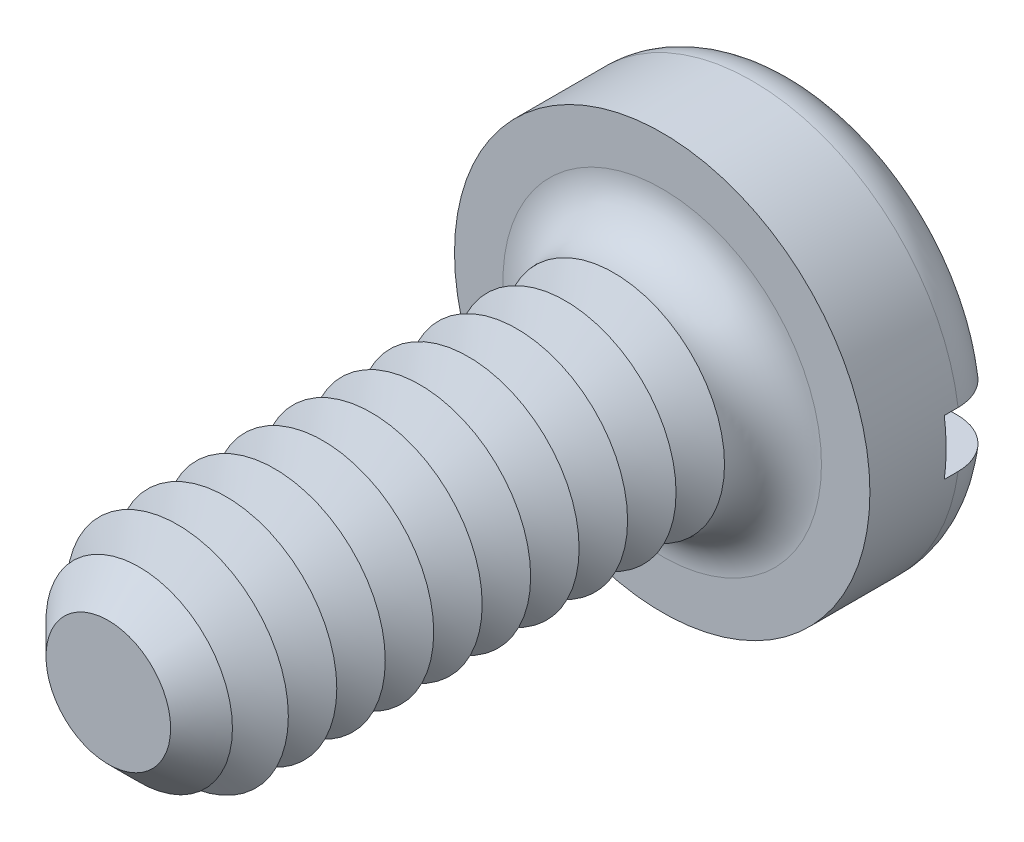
ISO-10303-21;
HEADER;
FILE_DESCRIPTION(('STEP AP214'),'2;1');
FILE_NAME('part.step','',(''),(''),'','','');
FILE_SCHEMA(('AUTOMOTIVE_DESIGN { 1 0 10303 214 1 1 1 1 }'));
ENDSEC;
DATA;
#1=APPLICATION_CONTEXT('core data for automotive mechanical design processes');
#2=APPLICATION_PROTOCOL_DEFINITION('international standard','automotive_design',2000,#1);
#3=PRODUCT_CONTEXT('',#1,'mechanical');
#4=PRODUCT('Part','Part','',(#3));
#5=PRODUCT_RELATED_PRODUCT_CATEGORY('part','',(#4));
#6=PRODUCT_DEFINITION_FORMATION('','',#4);
#7=PRODUCT_DEFINITION_CONTEXT('part definition',#1,'design');
#8=PRODUCT_DEFINITION('design','',#6,#7);
#9=PRODUCT_DEFINITION_SHAPE('','',#8);
#10=(LENGTH_UNIT() NAMED_UNIT(*) SI_UNIT(.MILLI.,.METRE.));
#11=(NAMED_UNIT(*) PLANE_ANGLE_UNIT() SI_UNIT($,.RADIAN.));
#12=(NAMED_UNIT(*) SI_UNIT($,.STERADIAN.) SOLID_ANGLE_UNIT());
#13=UNCERTAINTY_MEASURE_WITH_UNIT(LENGTH_MEASURE(1.E-05),#10,'distance_accuracy_value','');
#14=(GEOMETRIC_REPRESENTATION_CONTEXT(3) GLOBAL_UNCERTAINTY_ASSIGNED_CONTEXT((#13)) GLOBAL_UNIT_ASSIGNED_CONTEXT((#10,
#11,#12)) REPRESENTATION_CONTEXT('',''));
#15=CARTESIAN_POINT('',(0.,0.,0.));
#16=DIRECTION('',(0.,0.,1.));
#17=DIRECTION('',(1.,0.,0.));
#18=AXIS2_PLACEMENT_3D('',#15,#16,#17);
#19=CARTESIAN_POINT('',(0.,0.,-1.));
#20=DIRECTION('',(0.,0.,1.));
#21=DIRECTION('',(1.,0.,0.));
#22=AXIS2_PLACEMENT_3D('',#19,#20,#21);
#23=PLANE('',#22);
#24=CARTESIAN_POINT('',(0.,0.,-1.));
#25=DIRECTION('',(0.,0.,1.));
#26=DIRECTION('',(1.,0.,0.));
#27=AXIS2_PLACEMENT_3D('',#24,#25,#26);
#28=CIRCLE('',#27,1.15);
#29=CARTESIAN_POINT('',(-1.13247516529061,0.2,-1.));
#30=VERTEX_POINT('',#29);
#31=CARTESIAN_POINT('',(1.13247516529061,0.2,-1.));
#32=VERTEX_POINT('',#31);
#33=EDGE_CURVE('E116',#30,#32,#28,.F.);
#34=ORIENTED_EDGE('',*,*,#33,.T.);
#35=DIRECTION('',(1.,0.,0.));
#36=VECTOR('',#35,1.);
#37=CARTESIAN_POINT('',(-1.5,0.2,-1.));
#38=LINE('',#37,#36);
#39=EDGE_CURVE('E111',#30,#32,#38,.T.);
#40=ORIENTED_EDGE('',*,*,#39,.F.);
#41=EDGE_LOOP('',(#34,#40));
#42=FACE_BOUND('',#41,.T.);
#43=ADVANCED_FACE('F39',(#42),#23,.F.);
#44=CARTESIAN_POINT('',(0.,0.,-0.65));
#45=DIRECTION('',(0.,0.,1.));
#46=DIRECTION('',(1.,0.,0.));
#47=AXIS2_PLACEMENT_3D('',#44,#45,#46);
#48=TOROIDAL_SURFACE('',#47,1.15,0.35);
#49=CARTESIAN_POINT('',(-1.38697162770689,0.2,-0.89359719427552));
#50=CARTESIAN_POINT('',(-1.37305556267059,0.2,-0.907805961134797));
#51=CARTESIAN_POINT('',(-1.35791811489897,0.2,-0.9208403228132));
#52=CARTESIAN_POINT('',(-1.32565069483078,0.2,-0.944183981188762));
#53=CARTESIAN_POINT('',(-1.3085180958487,0.2,-0.954489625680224));
#54=CARTESIAN_POINT('',(-1.27278567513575,0.2,-0.972077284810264));
#55=CARTESIAN_POINT('',(-1.25418732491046,0.2,-0.979362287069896));
#56=CARTESIAN_POINT('',(-1.21604452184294,0.2,-0.990735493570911));
#57=CARTESIAN_POINT('',(-1.19650030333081,0.2,-0.994824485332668));
#58=CARTESIAN_POINT('',(-1.15682398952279,0.2,-0.99973845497));
#59=CARTESIAN_POINT('',(-1.1366881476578,0.2,-1.00053316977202));
#60=CARTESIAN_POINT('',(-1.09656272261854,0.2,-0.998770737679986));
#61=CARTESIAN_POINT('',(-1.07657315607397,0.2,-0.996213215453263));
#62=CARTESIAN_POINT('',(-1.03707277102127,0.2,-0.987780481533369));
#63=CARTESIAN_POINT('',(-1.01756977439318,0.2,-0.981868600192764));
#64=CARTESIAN_POINT('',(-0.979825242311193,0.2,-0.966867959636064));
#65=CARTESIAN_POINT('',(-0.961583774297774,0.2,-0.957779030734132));
#66=CARTESIAN_POINT('',(-0.926815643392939,0.2,-0.936628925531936));
#67=CARTESIAN_POINT('',(-0.910295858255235,0.2,-0.924556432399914));
#68=CARTESIAN_POINT('',(-0.879544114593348,0.2,-0.897781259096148));
#69=CARTESIAN_POINT('',(-0.8653120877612,0.2,-0.883078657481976));
#70=CARTESIAN_POINT('',(-0.83972745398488,0.2,-0.851619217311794));
#71=CARTESIAN_POINT('',(-0.8283448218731,0.2,-0.834886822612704));
#72=CARTESIAN_POINT('',(-0.80863848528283,0.2,-0.799707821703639));
#73=CARTESIAN_POINT('',(-0.80031425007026,0.2,-0.781261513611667));
#74=CARTESIAN_POINT('',(-0.787199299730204,0.2,-0.743695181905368));
#75=CARTESIAN_POINT('',(-0.782321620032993,0.2,-0.724605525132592));
#76=CARTESIAN_POINT('',(-0.775930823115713,0.2,-0.685871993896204));
#77=CARTESIAN_POINT('',(-0.774417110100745,0.2,-0.666228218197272));
#78=CARTESIAN_POINT('',(-0.774805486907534,0.2,-0.627456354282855));
#79=CARTESIAN_POINT('',(-0.776625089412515,0.2,-0.608327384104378));
#80=CARTESIAN_POINT('',(-0.783452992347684,0.2,-0.570648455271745));
#81=CARTESIAN_POINT('',(-0.788461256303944,0.2,-0.552098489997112));
#82=CARTESIAN_POINT('',(-0.801489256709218,0.2,-0.516098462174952));
#83=CARTESIAN_POINT('',(-0.809507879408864,0.2,-0.49864799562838));
#84=CARTESIAN_POINT('',(-0.828295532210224,0.2,-0.465297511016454));
#85=CARTESIAN_POINT('',(-0.839064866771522,0.2,-0.449397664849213));
#86=CARTESIAN_POINT('',(-0.863311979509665,0.2,-0.419196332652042));
#87=CARTESIAN_POINT('',(-0.876847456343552,0.2,-0.404941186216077));
#88=CARTESIAN_POINT('',(-0.906064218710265,0.2,-0.378832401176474));
#89=CARTESIAN_POINT('',(-0.921745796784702,0.2,-0.366979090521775));
#90=CARTESIAN_POINT('',(-0.955261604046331,0.2,-0.345690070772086));
#91=CARTESIAN_POINT('',(-0.973141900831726,0.2,-0.336326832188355));
#92=CARTESIAN_POINT('',(-1.01020647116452,0.2,-0.320690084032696));
#93=CARTESIAN_POINT('',(-1.02939085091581,0.2,-0.314416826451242));
#94=CARTESIAN_POINT('',(-1.06878849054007,0.2,-0.305073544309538));
#95=CARTESIAN_POINT('',(-1.0890118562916,0.2,-0.302046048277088));
#96=CARTESIAN_POINT('',(-1.12968032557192,0.2,-0.299436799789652));
#97=CARTESIAN_POINT('',(-1.15012542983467,0.2,-0.299855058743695));
#98=CARTESIAN_POINT('',(-1.1906059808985,0.2,-0.304138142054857));
#99=CARTESIAN_POINT('',(-1.21064224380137,0.2,-0.307995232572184));
#100=CARTESIAN_POINT('',(-1.24976957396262,0.2,-0.319055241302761));
#101=CARTESIAN_POINT('',(-1.26886068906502,0.2,-0.326257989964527));
#102=CARTESIAN_POINT('',(-1.30533597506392,0.2,-0.343725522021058));
#103=CARTESIAN_POINT('',(-1.32273620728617,0.2,-0.353956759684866));
#104=CARTESIAN_POINT('',(-1.35554323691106,0.2,-0.377229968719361));
#105=CARTESIAN_POINT('',(-1.37095016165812,0.2,-0.390271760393));
#106=CARTESIAN_POINT('',(-1.39913145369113,0.2,-0.418621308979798));
#107=CARTESIAN_POINT('',(-1.41193602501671,0.2,-0.43389904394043));
#108=CARTESIAN_POINT('',(-1.43476712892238,0.2,-0.46640589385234));
#109=CARTESIAN_POINT('',(-1.44479381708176,0.2,-0.483634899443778));
#110=CARTESIAN_POINT('',(-1.4616814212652,0.2,-0.519367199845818));
#111=CARTESIAN_POINT('',(-1.46857323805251,0.2,-0.537855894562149));
#112=CARTESIAN_POINT('',(-1.4791331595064,0.2,-0.575731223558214));
#113=CARTESIAN_POINT('',(-1.48280152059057,0.2,-0.595117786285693));
#114=CARTESIAN_POINT('',(-1.4867930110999,0.2,-0.634109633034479));
#115=CARTESIAN_POINT('',(-1.48713684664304,0.2,-0.653712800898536));
#116=CARTESIAN_POINT('',(-1.48452244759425,0.2,-0.692702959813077));
#117=CARTESIAN_POINT('',(-1.48156342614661,0.2,-0.712089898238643));
#118=CARTESIAN_POINT('',(-1.47243636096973,0.2,-0.75006822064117));
#119=CARTESIAN_POINT('',(-1.46627182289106,0.2,-0.768660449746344));
#120=CARTESIAN_POINT('',(-1.45092056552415,0.2,-0.804533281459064));
#121=CARTESIAN_POINT('',(-1.44173755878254,0.2,-0.821815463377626));
#122=CARTESIAN_POINT('',(-1.42477940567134,0.2,-0.848152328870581));
#123=CARTESIAN_POINT('',(-1.41786672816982,0.2,-0.857773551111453));
#124=CARTESIAN_POINT('',(-1.40310412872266,0.2,-0.876267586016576));
#125=CARTESIAN_POINT('',(-1.39525421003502,0.2,-0.885140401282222));
#126=CARTESIAN_POINT('',(-1.38697162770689,0.2,-0.89359719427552));
#127=B_SPLINE_CURVE_WITH_KNOTS('',3,(#49,#50,#51,#52,#53,#54,#55,#56,#57,#58,#59,#60,#61,#62,
#63,#64,#65,#66,#67,#68,#69,#70,#71,#72,#73,#74,#75,#76,#77,#78,#79,#80,#81,#82,#83,#84,#85,#86,
#87,#88,#89,#90,#91,#92,#93,#94,#95,#96,#97,#98,#99,#100,#101,#102,#103,#104,#105,#106,#107,
#108,#109,#110,#111,#112,#113,#114,#115,#116,#117,#118,#119,#120,#121,#122,#123,#124,#125,#126),
.UNSPECIFIED.,.T.,.F.,(4,2,2,2,2,2,2,2,2,2,2,2,2,2,2,2,2,2,2,2,2,2,2,2,2,2,2,2,2,2,2,2,2,2,2,2,
2,2,4),(0.,0.0596211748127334,0.119321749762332,0.178963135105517,0.238589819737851,
0.298763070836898,0.358943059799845,0.419793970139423,0.48064813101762,0.541736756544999,
0.602823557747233,0.663236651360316,0.72363925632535,0.782457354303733,0.841265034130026,
0.898637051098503,0.956008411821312,1.01335856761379,1.07071507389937,1.12941939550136,
1.18813172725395,1.24840147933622,1.30867614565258,1.36973127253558,1.43078660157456,
1.49170496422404,1.55262023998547,1.61288453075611,1.67314496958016,1.73266007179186,
1.792171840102,1.85108355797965,1.90999058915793,1.96853049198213,2.02708434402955,
2.08557429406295,2.14399257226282,2.17947810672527,2.21496351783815),.UNSPECIFIED.);
#128=CARTESIAN_POINT('',(-1.48660687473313,0.2,-0.649999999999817));
#129=VERTEX_POINT('',#128);
#130=EDGE_CURVE('E265',#129,#30,#127,.T.);
#131=ORIENTED_EDGE('',*,*,#130,.F.);
#132=CARTESIAN_POINT('',(0.,0.,-0.65));
#133=DIRECTION('',(0.,0.,1.));
#134=DIRECTION('',(1.,0.,0.));
#135=AXIS2_PLACEMENT_3D('',#132,#133,#134);
#136=CIRCLE('',#135,1.5);
#137=CARTESIAN_POINT('',(1.48660687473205,0.2,-0.649999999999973));
#138=VERTEX_POINT('',#137);
#139=EDGE_CURVE('E125',#138,#129,#136,.T.);
#140=ORIENTED_EDGE('',*,*,#139,.F.);
#141=CARTESIAN_POINT('',(0.780520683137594,0.2,-0.713112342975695));
#142=CARTESIAN_POINT('',(0.784146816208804,0.2,-0.73226748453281));
#143=CARTESIAN_POINT('',(0.789425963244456,0.2,-0.751125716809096));
#144=CARTESIAN_POINT('',(0.803106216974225,0.2,-0.78769198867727));
#145=CARTESIAN_POINT('',(0.811511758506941,0.2,-0.805398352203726));
#146=CARTESIAN_POINT('',(0.831144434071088,0.2,-0.839131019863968));
#147=CARTESIAN_POINT('',(0.842366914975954,0.2,-0.855160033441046));
#148=CARTESIAN_POINT('',(0.867288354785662,0.2,-0.88515062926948));
#149=CARTESIAN_POINT('',(0.880986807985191,0.2,-0.899112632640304));
#150=CARTESIAN_POINT('',(0.910770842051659,0.2,-0.924888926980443));
#151=CARTESIAN_POINT('',(0.926899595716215,0.2,-0.936653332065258));
#152=CARTESIAN_POINT('',(0.960871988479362,0.2,-0.957372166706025));
#153=CARTESIAN_POINT('',(0.978715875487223,0.2,-0.966326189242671));
#154=CARTESIAN_POINT('',(1.01600338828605,0.2,-0.981340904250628));
#155=CARTESIAN_POINT('',(1.03547204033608,0.2,-0.987339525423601));
#156=CARTESIAN_POINT('',(1.07513874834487,0.2,-0.995998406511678));
#157=CARTESIAN_POINT('',(1.09533683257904,0.2,-0.998658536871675));
#158=CARTESIAN_POINT('',(1.1359751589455,0.2,-1.0005575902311));
#159=CARTESIAN_POINT('',(1.1564160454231,0.2,-0.99978283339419));
#160=CARTESIAN_POINT('',(1.19687229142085,0.2,-0.994784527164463));
#161=CARTESIAN_POINT('',(1.21688766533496,0.2,-0.990561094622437));
#162=CARTESIAN_POINT('',(1.25575385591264,0.2,-0.978813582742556));
#163=CARTESIAN_POINT('',(1.27461259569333,0.2,-0.971315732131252));
#164=CARTESIAN_POINT('',(1.31078063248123,0.2,-0.953221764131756));
#165=CARTESIAN_POINT('',(1.32809002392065,0.2,-0.942625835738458));
#166=CARTESIAN_POINT('',(1.36044102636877,0.2,-0.918776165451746));
#167=CARTESIAN_POINT('',(1.37550786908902,0.2,-0.905556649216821));
#168=CARTESIAN_POINT('',(1.40317627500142,0.2,-0.876749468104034));
#169=CARTESIAN_POINT('',(1.41577799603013,0.2,-0.861161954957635));
#170=CARTESIAN_POINT('',(1.43800830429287,0.2,-0.828254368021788));
#171=CARTESIAN_POINT('',(1.44766923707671,0.2,-0.810956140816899));
#172=CARTESIAN_POINT('',(1.46392269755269,0.2,-0.774973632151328));
#173=CARTESIAN_POINT('',(1.4705153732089,0.2,-0.756289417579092));
#174=CARTESIAN_POINT('',(1.48039453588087,0.2,-0.718226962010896));
#175=CARTESIAN_POINT('',(1.48370713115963,0.2,-0.69885549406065));
#176=CARTESIAN_POINT('',(1.48701993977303,0.2,-0.659831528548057));
#177=CARTESIAN_POINT('',(1.4870202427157,0.2,-0.640179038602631));
#178=CARTESIAN_POINT('',(1.48371470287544,0.2,-0.6012267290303));
#179=CARTESIAN_POINT('',(1.48042091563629,0.2,-0.581925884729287));
#180=CARTESIAN_POINT('',(1.47064268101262,0.2,-0.544150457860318));
#181=CARTESIAN_POINT('',(1.46415824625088,0.2,-0.525675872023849));
#182=CARTESIAN_POINT('',(1.4481813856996,0.2,-0.490055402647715));
#183=CARTESIAN_POINT('',(1.43868601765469,0.2,-0.472910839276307));
#184=CARTESIAN_POINT('',(1.41696658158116,0.2,-0.440447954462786));
#185=CARTESIAN_POINT('',(1.40474246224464,0.2,-0.425129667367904));
#186=CARTESIAN_POINT('',(1.37784446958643,0.2,-0.39666049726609));
#187=CARTESIAN_POINT('',(1.36315749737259,0.2,-0.383521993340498));
#188=CARTESIAN_POINT('',(1.33180407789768,0.2,-0.359869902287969));
#189=CARTESIAN_POINT('',(1.31513754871,0.2,-0.349356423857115));
#190=CARTESIAN_POINT('',(1.28013085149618,0.2,-0.331143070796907));
#191=CARTESIAN_POINT('',(1.26177629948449,0.2,-0.323470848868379));
#192=CARTESIAN_POINT('',(1.224049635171,0.2,-0.311275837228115));
#193=CARTESIAN_POINT('',(1.20467746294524,0.2,-0.306753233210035));
#194=CARTESIAN_POINT('',(1.1652160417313,0.2,-0.300927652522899));
#195=CARTESIAN_POINT('',(1.14512096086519,0.2,-0.299664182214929));
#196=CARTESIAN_POINT('',(1.10499953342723,0.2,-0.300488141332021));
#197=CARTESIAN_POINT('',(1.08497319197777,0.2,-0.302575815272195));
#198=CARTESIAN_POINT('',(1.04531606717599,0.2,-0.310075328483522));
#199=CARTESIAN_POINT('',(1.0256923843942,0.2,-0.315524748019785));
#200=CARTESIAN_POINT('',(0.987629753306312,0.2,-0.329624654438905));
#201=CARTESIAN_POINT('',(0.96919087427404,0.2,-0.338275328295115));
#202=CARTESIAN_POINT('',(0.933939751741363,0.2,-0.358590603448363));
#203=CARTESIAN_POINT('',(0.917135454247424,0.2,-0.370269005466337));
#204=CARTESIAN_POINT('',(0.88574931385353,0.2,-0.396306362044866));
#205=CARTESIAN_POINT('',(0.87116734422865,0.2,-0.410665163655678));
#206=CARTESIAN_POINT('',(0.844813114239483,0.2,-0.441518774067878));
#207=CARTESIAN_POINT('',(0.833014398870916,0.2,-0.457990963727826));
#208=CARTESIAN_POINT('',(0.812431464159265,0.2,-0.492729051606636));
#209=CARTESIAN_POINT('',(0.803647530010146,0.2,-0.510995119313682));
#210=CARTESIAN_POINT('',(0.789590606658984,0.2,-0.548308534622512));
#211=CARTESIAN_POINT('',(0.784235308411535,0.2,-0.5673249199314));
#212=CARTESIAN_POINT('',(0.7768953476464,0.2,-0.605979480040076));
#213=CARTESIAN_POINT('',(0.774905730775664,0.2,-0.625616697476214));
#214=CARTESIAN_POINT('',(0.774470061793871,0.2,-0.656633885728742));
#215=CARTESIAN_POINT('',(0.7748847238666,0.2,-0.668009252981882));
#216=CARTESIAN_POINT('',(0.776852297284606,0.2,-0.690660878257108));
#217=CARTESIAN_POINT('',(0.77840517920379,0.2,-0.701937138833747));
#218=CARTESIAN_POINT('',(0.780520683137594,0.2,-0.713112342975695));
#219=B_SPLINE_CURVE_WITH_KNOTS('',3,(#141,#142,#143,#144,#145,#146,#147,#148,#149,#150,#151,
#152,#153,#154,#155,#156,#157,#158,#159,#160,#161,#162,#163,#164,#165,#166,#167,#168,#169,#170,
#171,#172,#173,#174,#175,#176,#177,#178,#179,#180,#181,#182,#183,#184,#185,#186,#187,#188,#189,
#190,#191,#192,#193,#194,#195,#196,#197,#198,#199,#200,#201,#202,#203,#204,#205,#206,#207,#208,
#209,#210,#211,#212,#213,#214,#215,#216,#217,#218),.UNSPECIFIED.,.T.,.F.,(4,2,2,2,2,2,2,2,2,2,2,
2,2,2,2,2,2,2,2,2,2,2,2,2,2,2,2,2,2,2,2,2,2,2,2,2,2,2,4),(0.,0.0584431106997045,
0.11696944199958,0.175399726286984,0.233818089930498,0.293433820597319,0.353058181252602,
0.413886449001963,0.474717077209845,0.53579018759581,0.596861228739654,0.65745180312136,
0.718038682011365,0.777881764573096,0.837721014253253,0.896876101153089,0.95602833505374,
1.01470585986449,1.07338179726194,1.13184377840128,1.19030552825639,1.24882458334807,
1.30734473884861,1.36618662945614,1.42503095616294,1.48443380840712,1.54384016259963,
1.60396331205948,1.66409084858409,1.72490303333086,1.78571877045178,1.84681674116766,
1.90791122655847,1.96839922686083,2.02889294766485,2.08787382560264,2.14676780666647,
2.18086468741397,2.21496068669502),.UNSPECIFIED.);
#220=EDGE_CURVE('E267',#32,#138,#219,.T.);
#221=ORIENTED_EDGE('',*,*,#220,.F.);
#222=ORIENTED_EDGE('',*,*,#33,.F.);
#223=EDGE_LOOP('',(#131,#140,#221,#222));
#224=FACE_BOUND('',#223,.T.);
#225=ADVANCED_FACE('F249',(#224),#48,.T.);
#226=CARTESIAN_POINT('',(0.,0.,-1.));
#227=DIRECTION('',(0.,0.,1.));
#228=DIRECTION('',(1.,0.,0.));
#229=AXIS2_PLACEMENT_3D('',#226,#227,#228);
#230=CYLINDRICAL_SURFACE('',#229,1.5);
#231=DIRECTION('',(0.,0.,1.));
#232=VECTOR('',#231,1.);
#233=CARTESIAN_POINT('',(1.48660687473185,0.2,-1.));
#234=LINE('',#233,#232);
#235=CARTESIAN_POINT('',(1.48660687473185,0.2,-0.55));
#236=VERTEX_POINT('',#235);
#237=EDGE_CURVE('E283',#138,#236,#234,.T.);
#238=ORIENTED_EDGE('',*,*,#237,.F.);
#239=ORIENTED_EDGE('',*,*,#139,.T.);
#240=DIRECTION('',(0.,0.,1.));
#241=VECTOR('',#240,1.);
#242=CARTESIAN_POINT('',(-1.48660687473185,0.2,-1.));
#243=LINE('',#242,#241);
#244=CARTESIAN_POINT('',(-1.48660687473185,0.2,-0.55));
#245=VERTEX_POINT('',#244);
#246=EDGE_CURVE('E63',#245,#129,#243,.F.);
#247=ORIENTED_EDGE('',*,*,#246,.F.);
#248=CARTESIAN_POINT('',(0.,0.,-0.55));
#249=DIRECTION('',(0.,0.,-1.));
#250=DIRECTION('',(-1.,0.,0.));
#251=AXIS2_PLACEMENT_3D('',#248,#249,#250);
#252=CIRCLE('',#251,1.5);
#253=CARTESIAN_POINT('',(-1.48660687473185,-0.2,-0.55));
#254=VERTEX_POINT('',#253);
#255=EDGE_CURVE('E43',#245,#254,#252,.F.);
#256=ORIENTED_EDGE('',*,*,#255,.T.);
#257=DIRECTION('',(0.,0.,1.));
#258=VECTOR('',#257,1.);
#259=CARTESIAN_POINT('',(-1.48660687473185,-0.2,-1.));
#260=LINE('',#259,#258);
#261=CARTESIAN_POINT('',(-1.48660687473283,-0.2,-0.650000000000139));
#262=VERTEX_POINT('',#261);
#263=EDGE_CURVE('E280',#262,#254,#260,.T.);
#264=ORIENTED_EDGE('',*,*,#263,.F.);
#265=CARTESIAN_POINT('',(1.48660687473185,-0.2,-0.65));
#266=VERTEX_POINT('',#265);
#267=EDGE_CURVE('E127',#262,#266,#136,.T.);
#268=ORIENTED_EDGE('',*,*,#267,.T.);
#269=DIRECTION('',(0.,0.,1.));
#270=VECTOR('',#269,1.);
#271=CARTESIAN_POINT('',(1.48660687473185,-0.2,-1.));
#272=LINE('',#271,#270);
#273=CARTESIAN_POINT('',(1.48660687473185,-0.2,-0.55));
#274=VERTEX_POINT('',#273);
#275=EDGE_CURVE('E55',#274,#266,#272,.F.);
#276=ORIENTED_EDGE('',*,*,#275,.F.);
#277=EDGE_CURVE('E11',#274,#236,#252,.F.);
#278=ORIENTED_EDGE('',*,*,#277,.T.);
#279=EDGE_LOOP('',(#238,#239,#247,#256,#264,#268,#276,#278));
#280=FACE_BOUND('',#279,.T.);
#281=CARTESIAN_POINT('',(0.,0.,0.));
#282=DIRECTION('',(0.,0.,1.));
#283=DIRECTION('',(1.,0.,0.));
#284=AXIS2_PLACEMENT_3D('',#281,#282,#283);
#285=CIRCLE('',#284,1.5);
#286=CARTESIAN_POINT('',(1.5,0.,0.));
#287=VERTEX_POINT('',#286);
#288=EDGE_CURVE('E286',#287,#287,#285,.T.);
#289=ORIENTED_EDGE('',*,*,#288,.F.);
#290=EDGE_LOOP('',(#289));
#291=FACE_BOUND('',#290,.T.);
#292=ADVANCED_FACE('F245',(#280,#291),#230,.T.);
#293=CARTESIAN_POINT('',(1.13247516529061,-0.2,-1.));
#294=VERTEX_POINT('',#293);
#295=CARTESIAN_POINT('',(-1.13247516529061,-0.2,-1.));
#296=VERTEX_POINT('',#295);
#297=EDGE_CURVE('E109',#294,#296,#28,.F.);
#298=ORIENTED_EDGE('',*,*,#297,.T.);
#299=DIRECTION('',(-1.,0.,0.));
#300=VECTOR('',#299,1.);
#301=CARTESIAN_POINT('',(-1.5,-0.2,-1.));
#302=LINE('',#301,#300);
#303=EDGE_CURVE('E96',#294,#296,#302,.T.);
#304=ORIENTED_EDGE('',*,*,#303,.F.);
#305=EDGE_LOOP('',(#298,#304));
#306=FACE_BOUND('',#305,.T.);
#307=ADVANCED_FACE('F108',(#306),#23,.F.);
#308=CARTESIAN_POINT('',(0.,0.,0.));
#309=DIRECTION('',(0.,0.,1.));
#310=DIRECTION('',(1.,0.,0.));
#311=AXIS2_PLACEMENT_3D('',#308,#309,#310);
#312=PLANE('',#311);
#313=CARTESIAN_POINT('',(0.,0.,0.));
#314=DIRECTION('',(0.,0.,1.));
#315=DIRECTION('',(1.,0.,0.));
#316=AXIS2_PLACEMENT_3D('',#313,#314,#315);
#317=CIRCLE('',#316,1.15);
#318=CARTESIAN_POINT('',(1.15,0.,0.));
#319=VERTEX_POINT('',#318);
#320=EDGE_CURVE('E115',#319,#319,#317,.F.);
#321=ORIENTED_EDGE('',*,*,#320,.T.);
#322=EDGE_LOOP('',(#321));
#323=FACE_BOUND('',#322,.T.);
#324=ORIENTED_EDGE('',*,*,#288,.T.);
#325=EDGE_LOOP('',(#324));
#326=FACE_BOUND('',#325,.T.);
#327=ADVANCED_FACE('F244',(#323,#326),#312,.T.);
#328=CARTESIAN_POINT('',(-1.38697162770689,-0.2,-0.89359719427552));
#329=CARTESIAN_POINT('',(-1.40068341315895,-0.2,-0.87959447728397));
#330=CARTESIAN_POINT('',(-1.41322919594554,-0.2,-0.864431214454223));
#331=CARTESIAN_POINT('',(-1.43561095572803,-0.2,-0.83220389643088));
#332=CARTESIAN_POINT('',(-1.44544396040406,-0.2,-0.815137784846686));
#333=CARTESIAN_POINT('',(-1.46209732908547,-0.2,-0.779595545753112));
#334=CARTESIAN_POINT('',(-1.46891825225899,-0.2,-0.761119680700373));
#335=CARTESIAN_POINT('',(-1.479344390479,-0.2,-0.723286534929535));
#336=CARTESIAN_POINT('',(-1.48295036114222,-0.2,-0.703929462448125));
#337=CARTESIAN_POINT('',(-1.48683413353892,-0.2,-0.6649653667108));
#338=CARTESIAN_POINT('',(-1.48712565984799,-0.2,-0.645359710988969));
#339=CARTESIAN_POINT('',(-1.48440736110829,-0.2,-0.606378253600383));
#340=CARTESIAN_POINT('',(-1.48139747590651,-0.2,-0.587002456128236));
#341=CARTESIAN_POINT('',(-1.47217267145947,-0.2,-0.549061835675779));
#342=CARTESIAN_POINT('',(-1.46596274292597,-0.2,-0.530495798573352));
#343=CARTESIAN_POINT('',(-1.45052327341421,-0.2,-0.494665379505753));
#344=CARTESIAN_POINT('',(-1.44129371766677,-0.2,-0.477401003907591));
#345=CARTESIAN_POINT('',(-1.42005139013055,-0.2,-0.444603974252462));
#346=CARTESIAN_POINT('',(-1.40803014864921,-0.2,-0.429076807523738));
#347=CARTESIAN_POINT('',(-1.38156905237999,-0.2,-0.400242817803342));
#348=CARTESIAN_POINT('',(-1.36712913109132,-0.2,-0.386936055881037));
#349=CARTESIAN_POINT('',(-1.33612890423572,-0.2,-0.362811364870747));
#350=CARTESIAN_POINT('',(-1.31955365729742,-0.2,-0.352012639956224));
#351=CARTESIAN_POINT('',(-1.28484098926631,-0.2,-0.333316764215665));
#352=CARTESIAN_POINT('',(-1.26670348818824,-0.2,-0.325419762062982));
#353=CARTESIAN_POINT('',(-1.22917040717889,-0.2,-0.31265726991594));
#354=CARTESIAN_POINT('',(-1.20976324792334,-0.2,-0.3078258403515));
#355=CARTESIAN_POINT('',(-1.17041685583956,-0.2,-0.30144641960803));
#356=CARTESIAN_POINT('',(-1.15047758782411,-0.2,-0.299898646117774));
#357=CARTESIAN_POINT('',(-1.11037109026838,-0.2,-0.300112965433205));
#358=CARTESIAN_POINT('',(-1.09020407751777,-0.2,-0.301916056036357));
#359=CARTESIAN_POINT('',(-1.05044996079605,-0.2,-0.308849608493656));
#360=CARTESIAN_POINT('',(-1.03086289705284,-0.2,-0.313980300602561));
#361=CARTESIAN_POINT('',(-0.992636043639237,-0.2,-0.327485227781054));
#362=CARTESIAN_POINT('',(-0.974006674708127,-0.2,-0.335888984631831));
#363=CARTESIAN_POINT('',(-0.938423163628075,-0.2,-0.355707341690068));
#364=CARTESIAN_POINT('',(-0.921469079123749,-0.2,-0.367122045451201));
#365=CARTESIAN_POINT('',(-0.889752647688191,-0.2,-0.392642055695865));
#366=CARTESIAN_POINT('',(-0.874987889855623,-0.2,-0.406744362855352));
#367=CARTESIAN_POINT('',(-0.848085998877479,-0.2,-0.437266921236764));
#368=CARTESIAN_POINT('',(-0.835948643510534,-0.2,-0.453686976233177));
#369=CARTESIAN_POINT('',(-0.814894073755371,-0.2,-0.488078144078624));
#370=CARTESIAN_POINT('',(-0.805923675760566,-0.2,-0.506016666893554));
#371=CARTESIAN_POINT('',(-0.791223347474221,-0.2,-0.543175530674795));
#372=CARTESIAN_POINT('',(-0.78549275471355,-0.2,-0.562395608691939));
#373=CARTESIAN_POINT('',(-0.777599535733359,-0.2,-0.600984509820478));
#374=CARTESIAN_POINT('',(-0.775340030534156,-0.2,-0.62033354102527));
#375=CARTESIAN_POINT('',(-0.774164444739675,-0.2,-0.659131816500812));
#376=CARTESIAN_POINT('',(-0.775247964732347,-0.2,-0.678581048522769));
#377=CARTESIAN_POINT('',(-0.78067015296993,-0.2,-0.716679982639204));
#378=CARTESIAN_POINT('',(-0.784953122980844,-0.2,-0.735337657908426));
#379=CARTESIAN_POINT('',(-0.796558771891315,-0.2,-0.771681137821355));
#380=CARTESIAN_POINT('',(-0.803881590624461,-0.2,-0.789366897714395));
#381=CARTESIAN_POINT('',(-0.821417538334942,-0.2,-0.823475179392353));
#382=CARTESIAN_POINT('',(-0.831660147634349,-0.2,-0.839882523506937));
#383=CARTESIAN_POINT('',(-0.854684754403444,-0.2,-0.870805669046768));
#384=CARTESIAN_POINT('',(-0.867467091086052,-0.2,-0.885321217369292));
#385=CARTESIAN_POINT('',(-0.895584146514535,-0.2,-0.912470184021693));
#386=CARTESIAN_POINT('',(-0.910979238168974,-0.2,-0.925041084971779));
#387=CARTESIAN_POINT('',(-0.943622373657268,-0.2,-0.947488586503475));
#388=CARTESIAN_POINT('',(-0.960870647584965,-0.2,-0.957364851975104));
#389=CARTESIAN_POINT('',(-0.997151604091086,-0.2,-0.974359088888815));
#390=CARTESIAN_POINT('',(-1.01621564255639,-0.2,-0.98141019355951));
#391=CARTESIAN_POINT('',(-1.05525219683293,-0.2,-0.992235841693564));
#392=CARTESIAN_POINT('',(-1.07522472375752,-0.2,-0.996010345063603));
#393=CARTESIAN_POINT('',(-1.11565152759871,-0.2,-1.00018247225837));
#394=CARTESIAN_POINT('',(-1.1361080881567,-0.2,-1.00055804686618));
#395=CARTESIAN_POINT('',(-1.17679659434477,-0.2,-0.997846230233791));
#396=CARTESIAN_POINT('',(-1.19702848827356,-0.2,-0.994758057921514));
#397=CARTESIAN_POINT('',(-1.23655375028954,-0.2,-0.985216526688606));
#398=CARTESIAN_POINT('',(-1.25585198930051,-0.2,-0.978783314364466));
#399=CARTESIAN_POINT('',(-1.29305658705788,-0.2,-0.962732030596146));
#400=CARTESIAN_POINT('',(-1.31096467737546,-0.2,-0.953118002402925));
#401=CARTESIAN_POINT('',(-1.33859353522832,-0.2,-0.935076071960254));
#402=CARTESIAN_POINT('',(-1.34889525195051,-0.2,-0.927521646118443));
#403=CARTESIAN_POINT('',(-1.36861998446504,-0.2,-0.911341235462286));
#404=CARTESIAN_POINT('',(-1.37804300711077,-0.2,-0.90271525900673));
#405=CARTESIAN_POINT('',(-1.38697162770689,-0.2,-0.89359719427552));
#406=B_SPLINE_CURVE_WITH_KNOTS('',3,(#328,#329,#330,#331,#332,#333,#334,#335,#336,#337,#338,
#339,#340,#341,#342,#343,#344,#345,#346,#347,#348,#349,#350,#351,#352,#353,#354,#355,#356,#357,
#358,#359,#360,#361,#362,#363,#364,#365,#366,#367,#368,#369,#370,#371,#372,#373,#374,#375,#376,
#377,#378,#379,#380,#381,#382,#383,#384,#385,#386,#387,#388,#389,#390,#391,#392,#393,#394,#395,
#396,#397,#398,#399,#400,#401,#402,#403,#404,#405),.UNSPECIFIED.,.T.,.F.,(4,2,2,2,2,2,2,2,2,2,2,
2,2,2,2,2,2,2,2,2,2,2,2,2,2,2,2,2,2,2,2,2,2,2,2,2,2,2,4),(0.,0.0587484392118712,
0.117560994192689,0.17636262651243,0.235150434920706,0.293694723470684,0.352240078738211,
0.410694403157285,0.46914901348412,0.527783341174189,0.586419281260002,0.645490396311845,
0.704564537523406,0.76428403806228,0.824007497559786,0.884466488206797,0.944929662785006,
1.00595131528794,1.06697506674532,1.12793111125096,1.18888199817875,1.2487542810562,
1.30861431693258,1.36677117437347,1.4249210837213,1.48208160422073,1.53924475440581,
1.59700685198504,1.65477666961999,1.71413044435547,1.77349159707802,1.83418476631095,
1.89487867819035,1.95596603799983,2.01706717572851,2.07780450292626,2.13846491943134,
2.17672008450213,2.21497495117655),.UNSPECIFIED.);
#407=EDGE_CURVE('E103',#296,#262,#406,.T.);
#408=ORIENTED_EDGE('',*,*,#407,.F.);
#409=ORIENTED_EDGE('',*,*,#297,.F.);
#410=CARTESIAN_POINT('',(0.780520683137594,-0.2,-0.713112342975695));
#411=CARTESIAN_POINT('',(0.776967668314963,-0.2,-0.694332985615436));
#412=CARTESIAN_POINT('',(0.774997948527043,-0.2,-0.675240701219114));
#413=CARTESIAN_POINT('',(0.774305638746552,-0.2,-0.636983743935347));
#414=CARTESIAN_POINT('',(0.775586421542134,-0.2,-0.617819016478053));
#415=CARTESIAN_POINT('',(0.781350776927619,-0.2,-0.579992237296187));
#416=CARTESIAN_POINT('',(0.78583187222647,-0.2,-0.56132980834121));
#417=CARTESIAN_POINT('',(0.797836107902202,-0.2,-0.525016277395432));
#418=CARTESIAN_POINT('',(0.805358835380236,-0.2,-0.507365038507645));
#419=CARTESIAN_POINT('',(0.823276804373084,-0.2,-0.47338978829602));
#420=CARTESIAN_POINT('',(0.833696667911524,-0.2,-0.457078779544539));
#421=CARTESIAN_POINT('',(0.857057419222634,-0.2,-0.426375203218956));
#422=CARTESIAN_POINT('',(0.869998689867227,-0.2,-0.411982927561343));
#423=CARTESIAN_POINT('',(0.898418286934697,-0.2,-0.38510575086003));
#424=CARTESIAN_POINT('',(0.913956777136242,-0.2,-0.372684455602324));
#425=CARTESIAN_POINT('',(0.946860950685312,-0.2,-0.350558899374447));
#426=CARTESIAN_POINT('',(0.964226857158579,-0.2,-0.340854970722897));
#427=CARTESIAN_POINT('',(1.00070854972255,-0.2,-0.324232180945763));
#428=CARTESIAN_POINT('',(1.01985442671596,-0.2,-0.317379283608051));
#429=CARTESIAN_POINT('',(1.0590214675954,-0.2,-0.306962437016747));
#430=CARTESIAN_POINT('',(1.07904267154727,-0.2,-0.303398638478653));
#431=CARTESIAN_POINT('',(1.11952320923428,-0.2,-0.299657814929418));
#432=CARTESIAN_POINT('',(1.13998446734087,-0.2,-0.299501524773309));
#433=CARTESIAN_POINT('',(1.1806395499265,-0.2,-0.302650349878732));
#434=CARTESIAN_POINT('',(1.20083338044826,-0.2,-0.305955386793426));
#435=CARTESIAN_POINT('',(1.24023260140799,-0.2,-0.315918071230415));
#436=CARTESIAN_POINT('',(1.25944372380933,-0.2,-0.322553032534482));
#437=CARTESIAN_POINT('',(1.29645854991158,-0.2,-0.338992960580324));
#438=CARTESIAN_POINT('',(1.31426233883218,-0.2,-0.348797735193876));
#439=CARTESIAN_POINT('',(1.34772734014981,-0.2,-0.371172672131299));
#440=CARTESIAN_POINT('',(1.36341179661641,-0.2,-0.383708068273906));
#441=CARTESIAN_POINT('',(1.39242189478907,-0.2,-0.41126267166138));
#442=CARTESIAN_POINT('',(1.40574768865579,-0.2,-0.426281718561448));
#443=CARTESIAN_POINT('',(1.42949833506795,-0.2,-0.458186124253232));
#444=CARTESIAN_POINT('',(1.43995542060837,-0.2,-0.475047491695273));
#445=CARTESIAN_POINT('',(1.45786189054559,-0.2,-0.510298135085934));
#446=CARTESIAN_POINT('',(1.46531142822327,-0.2,-0.528687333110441));
#447=CARTESIAN_POINT('',(1.47692889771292,-0.2,-0.566301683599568));
#448=CARTESIAN_POINT('',(1.48112438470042,-0.2,-0.585518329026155));
#449=CARTESIAN_POINT('',(1.48621428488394,-0.2,-0.624383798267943));
#450=CARTESIAN_POINT('',(1.48710879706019,-0.2,-0.644032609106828));
#451=CARTESIAN_POINT('',(1.48557356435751,-0.2,-0.683115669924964));
#452=CARTESIAN_POINT('',(1.48315796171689,-0.2,-0.702550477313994));
#453=CARTESIAN_POINT('',(1.47509909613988,-0.2,-0.740738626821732));
#454=CARTESIAN_POINT('',(1.46945585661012,-0.2,-0.759491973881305));
#455=CARTESIAN_POINT('',(1.45510530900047,-0.2,-0.79579446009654));
#456=CARTESIAN_POINT('',(1.44639690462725,-0.2,-0.813343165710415));
#457=CARTESIAN_POINT('',(1.42617120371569,-0.2,-0.846738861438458));
#458=CARTESIAN_POINT('',(1.41465386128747,-0.2,-0.862585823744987));
#459=CARTESIAN_POINT('',(1.3890808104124,-0.2,-0.892214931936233));
#460=CARTESIAN_POINT('',(1.37501291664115,-0.2,-0.90598655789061));
#461=CARTESIAN_POINT('',(1.34478283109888,-0.2,-0.930997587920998));
#462=CARTESIAN_POINT('',(1.32862056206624,-0.2,-0.942236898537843));
#463=CARTESIAN_POINT('',(1.29450693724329,-0.2,-0.96197581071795));
#464=CARTESIAN_POINT('',(1.27654077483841,-0.2,-0.970449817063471));
#465=CARTESIAN_POINT('',(1.23945233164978,-0.2,-0.984300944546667));
#466=CARTESIAN_POINT('',(1.2203299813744,-0.2,-0.989677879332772));
#467=CARTESIAN_POINT('',(1.18123021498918,-0.2,-0.997250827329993));
#468=CARTESIAN_POINT('',(1.16124534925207,-0.2,-0.999408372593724));
#469=CARTESIAN_POINT('',(1.12119456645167,-0.2,-1.00037966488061));
#470=CARTESIAN_POINT('',(1.10112864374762,-0.2,-0.999193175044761));
#471=CARTESIAN_POINT('',(1.06123417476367,-0.2,-0.993489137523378));
#472=CARTESIAN_POINT('',(1.0414112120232,-0.2,-0.988932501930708));
#473=CARTESIAN_POINT('',(1.00280276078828,-0.2,-0.976576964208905));
#474=CARTESIAN_POINT('',(0.984017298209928,-0.2,-0.968777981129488));
#475=CARTESIAN_POINT('',(0.947906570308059,-0.2,-0.95009587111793));
#476=CARTESIAN_POINT('',(0.930590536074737,-0.2,-0.939194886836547));
#477=CARTESIAN_POINT('',(0.89804559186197,-0.2,-0.914617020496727));
#478=CARTESIAN_POINT('',(0.882817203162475,-0.2,-0.900939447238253));
#479=CARTESIAN_POINT('',(0.855020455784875,-0.2,-0.871287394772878));
#480=CARTESIAN_POINT('',(0.84243415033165,-0.2,-0.855329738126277));
#481=CARTESIAN_POINT('',(0.820210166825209,-0.2,-0.821497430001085));
#482=CARTESIAN_POINT('',(0.810568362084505,-0.2,-0.803625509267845));
#483=CARTESIAN_POINT('',(0.797588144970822,-0.2,-0.773519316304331));
#484=CARTESIAN_POINT('',(0.793244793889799,-0.2,-0.761708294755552));
#485=CARTESIAN_POINT('',(0.785879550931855,-0.2,-0.737680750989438));
#486=CARTESIAN_POINT('',(0.782857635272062,-0.2,-0.725464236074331));
#487=CARTESIAN_POINT('',(0.780520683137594,-0.2,-0.713112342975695));
#488=B_SPLINE_CURVE_WITH_KNOTS('',3,(#410,#411,#412,#413,#414,#415,#416,#417,#418,#419,#420,
#421,#422,#423,#424,#425,#426,#427,#428,#429,#430,#431,#432,#433,#434,#435,#436,#437,#438,#439,
#440,#441,#442,#443,#444,#445,#446,#447,#448,#449,#450,#451,#452,#453,#454,#455,#456,#457,#458,
#459,#460,#461,#462,#463,#464,#465,#466,#467,#468,#469,#470,#471,#472,#473,#474,#475,#476,#477,
#478,#479,#480,#481,#482,#483,#484,#485,#486,#487),.UNSPECIFIED.,.T.,.F.,(4,2,2,2,2,2,2,2,2,2,2,
2,2,2,2,2,2,2,2,2,2,2,2,2,2,2,2,2,2,2,2,2,2,2,2,2,2,2,4),(0.,0.057291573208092,
0.114642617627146,0.171949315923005,0.229248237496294,0.287049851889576,0.344860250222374,
0.404266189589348,0.463679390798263,0.524399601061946,0.585122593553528,0.646214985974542,
0.707305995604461,0.767986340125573,0.828663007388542,0.888608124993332,0.948549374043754,
1.00778662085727,1.06702084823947,1.12574783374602,1.18447305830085,1.24294816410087,
1.30142284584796,1.35991846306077,1.41841503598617,1.47719881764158,1.5359847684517,
1.59530034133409,1.65461948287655,1.71464189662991,1.77466856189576,1.83540257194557,
1.89613809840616,1.9572305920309,2.01833831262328,2.0790164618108,2.13960917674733,
2.17729268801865,2.21497552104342),.UNSPECIFIED.);
#489=EDGE_CURVE('E92',#266,#294,#488,.T.);
#490=ORIENTED_EDGE('',*,*,#489,.F.);
#491=ORIENTED_EDGE('',*,*,#267,.F.);
#492=EDGE_LOOP('',(#408,#409,#490,#491));
#493=FACE_BOUND('',#492,.T.);
#494=ADVANCED_FACE('F113',(#493),#48,.T.);
#495=CARTESIAN_POINT('',(0.,0.,0.35));
#496=DIRECTION('',(0.,0.,1.));
#497=DIRECTION('',(1.,0.,0.));
#498=AXIS2_PLACEMENT_3D('',#495,#496,#497);
#499=TOROIDAL_SURFACE('',#498,1.15,0.35);
#500=ORIENTED_EDGE('',*,*,#320,.F.);
#501=EDGE_LOOP('',(#500));
#502=FACE_BOUND('',#501,.T.);
#503=CARTESIAN_POINT('',(0.,0.,0.35));
#504=DIRECTION('',(0.,0.,-1.));
#505=DIRECTION('',(-1.,0.,0.));
#506=AXIS2_PLACEMENT_3D('',#503,#504,#505);
#507=CIRCLE('',#506,0.8);
#508=CARTESIAN_POINT('',(-0.8,0.,0.35));
#509=VERTEX_POINT('',#508);
#510=EDGE_CURVE('E291',#509,#509,#507,.T.);
#511=ORIENTED_EDGE('',*,*,#510,.T.);
#512=EDGE_LOOP('',(#511));
#513=FACE_BOUND('',#512,.T.);
#514=ADVANCED_FACE('F237',(#502,#513),#499,.F.);
#515=CARTESIAN_POINT('',(0.,0.,0.524999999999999));
#516=DIRECTION('',(0.,0.,-1.));
#517=DIRECTION('',(-1.,0.,0.));
#518=AXIS2_PLACEMENT_3D('',#515,#516,#517);
#519=CONICAL_SURFACE('',#518,0.496891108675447,1.0471975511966);
#520=ORIENTED_EDGE('',*,*,#510,.F.);
#521=EDGE_LOOP('',(#520));
#522=FACE_BOUND('',#521,.T.);
#523=CARTESIAN_POINT('',(0.,0.,0.524999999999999));
#524=DIRECTION('',(0.,0.,-1.));
#525=DIRECTION('',(-1.,0.,0.));
#526=AXIS2_PLACEMENT_3D('',#523,#524,#525);
#527=CIRCLE('',#526,0.496891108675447);
#528=CARTESIAN_POINT('',(-0.496891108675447,0.,0.524999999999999));
#529=VERTEX_POINT('',#528);
#530=EDGE_CURVE('E296',#529,#529,#527,.T.);
#531=ORIENTED_EDGE('',*,*,#530,.T.);
#532=EDGE_LOOP('',(#531));
#533=FACE_BOUND('',#532,.T.);
#534=ADVANCED_FACE('F233',(#522,#533),#519,.T.);
#535=CARTESIAN_POINT('',(0.,0.,0.7));
#536=DIRECTION('',(0.,0.,1.));
#537=DIRECTION('',(1.,0.,0.));
#538=AXIS2_PLACEMENT_3D('',#535,#536,#537);
#539=CONICAL_SURFACE('',#538,0.8,1.0471975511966);
#540=ORIENTED_EDGE('',*,*,#530,.F.);
#541=EDGE_LOOP('',(#540));
#542=FACE_BOUND('',#541,.T.);
#543=CARTESIAN_POINT('',(0.,0.,0.7));
#544=DIRECTION('',(0.,0.,-1.));
#545=DIRECTION('',(-1.,0.,0.));
#546=AXIS2_PLACEMENT_3D('',#543,#544,#545);
#547=CIRCLE('',#546,0.8);
#548=CARTESIAN_POINT('',(-0.8,0.,0.7));
#549=VERTEX_POINT('',#548);
#550=EDGE_CURVE('E302',#549,#549,#547,.T.);
#551=ORIENTED_EDGE('',*,*,#550,.T.);
#552=EDGE_LOOP('',(#551));
#553=FACE_BOUND('',#552,.T.);
#554=ADVANCED_FACE('F229',(#542,#553),#539,.T.);
#555=CARTESIAN_POINT('',(0.,0.,0.874999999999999));
#556=DIRECTION('',(0.,0.,-1.));
#557=DIRECTION('',(-1.,0.,0.));
#558=AXIS2_PLACEMENT_3D('',#555,#556,#557);
#559=CONICAL_SURFACE('',#558,0.496891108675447,1.0471975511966);
#560=ORIENTED_EDGE('',*,*,#550,.F.);
#561=EDGE_LOOP('',(#560));
#562=FACE_BOUND('',#561,.T.);
#563=CARTESIAN_POINT('',(0.,0.,0.874999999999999));
#564=DIRECTION('',(0.,0.,-1.));
#565=DIRECTION('',(-1.,0.,0.));
#566=AXIS2_PLACEMENT_3D('',#563,#564,#565);
#567=CIRCLE('',#566,0.496891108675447);
#568=CARTESIAN_POINT('',(-0.496891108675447,0.,0.874999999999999));
#569=VERTEX_POINT('',#568);
#570=EDGE_CURVE('E306',#569,#569,#567,.T.);
#571=ORIENTED_EDGE('',*,*,#570,.T.);
#572=EDGE_LOOP('',(#571));
#573=FACE_BOUND('',#572,.T.);
#574=ADVANCED_FACE('F225',(#562,#573),#559,.T.);
#575=CARTESIAN_POINT('',(0.,0.,1.05));
#576=DIRECTION('',(0.,0.,1.));
#577=DIRECTION('',(1.,0.,0.));
#578=AXIS2_PLACEMENT_3D('',#575,#576,#577);
#579=CONICAL_SURFACE('',#578,0.8,1.0471975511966);
#580=ORIENTED_EDGE('',*,*,#570,.F.);
#581=EDGE_LOOP('',(#580));
#582=FACE_BOUND('',#581,.T.);
#583=CARTESIAN_POINT('',(0.,0.,1.05));
#584=DIRECTION('',(0.,0.,-1.));
#585=DIRECTION('',(-1.,0.,0.));
#586=AXIS2_PLACEMENT_3D('',#583,#584,#585);
#587=CIRCLE('',#586,0.8);
#588=CARTESIAN_POINT('',(-0.8,0.,1.05));
#589=VERTEX_POINT('',#588);
#590=EDGE_CURVE('E309',#589,#589,#587,.T.);
#591=ORIENTED_EDGE('',*,*,#590,.T.);
#592=EDGE_LOOP('',(#591));
#593=FACE_BOUND('',#592,.T.);
#594=ADVANCED_FACE('F221',(#582,#593),#579,.T.);
#595=CARTESIAN_POINT('',(0.,0.,1.225));
#596=DIRECTION('',(0.,0.,-1.));
#597=DIRECTION('',(-1.,0.,0.));
#598=AXIS2_PLACEMENT_3D('',#595,#596,#597);
#599=CONICAL_SURFACE('',#598,0.496891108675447,1.0471975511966);
#600=ORIENTED_EDGE('',*,*,#590,.F.);
#601=EDGE_LOOP('',(#600));
#602=FACE_BOUND('',#601,.T.);
#603=CARTESIAN_POINT('',(0.,0.,1.225));
#604=DIRECTION('',(0.,0.,-1.));
#605=DIRECTION('',(-1.,0.,0.));
#606=AXIS2_PLACEMENT_3D('',#603,#604,#605);
#607=CIRCLE('',#606,0.496891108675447);
#608=CARTESIAN_POINT('',(-0.496891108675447,0.,1.225));
#609=VERTEX_POINT('',#608);
#610=EDGE_CURVE('E313',#609,#609,#607,.T.);
#611=ORIENTED_EDGE('',*,*,#610,.T.);
#612=EDGE_LOOP('',(#611));
#613=FACE_BOUND('',#612,.T.);
#614=ADVANCED_FACE('F217',(#602,#613),#599,.T.);
#615=CARTESIAN_POINT('',(0.,0.,1.4));
#616=DIRECTION('',(0.,0.,1.));
#617=DIRECTION('',(1.,0.,0.));
#618=AXIS2_PLACEMENT_3D('',#615,#616,#617);
#619=CONICAL_SURFACE('',#618,0.8,1.0471975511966);
#620=ORIENTED_EDGE('',*,*,#610,.F.);
#621=EDGE_LOOP('',(#620));
#622=FACE_BOUND('',#621,.T.);
#623=CARTESIAN_POINT('',(0.,0.,1.4));
#624=DIRECTION('',(0.,0.,-1.));
#625=DIRECTION('',(-1.,0.,0.));
#626=AXIS2_PLACEMENT_3D('',#623,#624,#625);
#627=CIRCLE('',#626,0.8);
#628=CARTESIAN_POINT('',(-0.8,0.,1.4));
#629=VERTEX_POINT('',#628);
#630=EDGE_CURVE('E317',#629,#629,#627,.T.);
#631=ORIENTED_EDGE('',*,*,#630,.T.);
#632=EDGE_LOOP('',(#631));
#633=FACE_BOUND('',#632,.T.);
#634=ADVANCED_FACE('F213',(#622,#633),#619,.T.);
#635=CARTESIAN_POINT('',(0.,0.,1.575));
#636=DIRECTION('',(0.,0.,-1.));
#637=DIRECTION('',(-1.,0.,0.));
#638=AXIS2_PLACEMENT_3D('',#635,#636,#637);
#639=CONICAL_SURFACE('',#638,0.496891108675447,1.0471975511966);
#640=ORIENTED_EDGE('',*,*,#630,.F.);
#641=EDGE_LOOP('',(#640));
#642=FACE_BOUND('',#641,.T.);
#643=CARTESIAN_POINT('',(0.,0.,1.575));
#644=DIRECTION('',(0.,0.,-1.));
#645=DIRECTION('',(-1.,0.,0.));
#646=AXIS2_PLACEMENT_3D('',#643,#644,#645);
#647=CIRCLE('',#646,0.496891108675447);
#648=CARTESIAN_POINT('',(-0.496891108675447,0.,1.575));
#649=VERTEX_POINT('',#648);
#650=EDGE_CURVE('E321',#649,#649,#647,.T.);
#651=ORIENTED_EDGE('',*,*,#650,.T.);
#652=EDGE_LOOP('',(#651));
#653=FACE_BOUND('',#652,.T.);
#654=ADVANCED_FACE('F209',(#642,#653),#639,.T.);
#655=CARTESIAN_POINT('',(0.,0.,1.75));
#656=DIRECTION('',(0.,0.,1.));
#657=DIRECTION('',(1.,0.,0.));
#658=AXIS2_PLACEMENT_3D('',#655,#656,#657);
#659=CONICAL_SURFACE('',#658,0.8,1.0471975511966);
#660=ORIENTED_EDGE('',*,*,#650,.F.);
#661=EDGE_LOOP('',(#660));
#662=FACE_BOUND('',#661,.T.);
#663=CARTESIAN_POINT('',(0.,0.,1.75));
#664=DIRECTION('',(0.,0.,-1.));
#665=DIRECTION('',(-1.,0.,0.));
#666=AXIS2_PLACEMENT_3D('',#663,#664,#665);
#667=CIRCLE('',#666,0.8);
#668=CARTESIAN_POINT('',(-0.8,0.,1.75));
#669=VERTEX_POINT('',#668);
#670=EDGE_CURVE('E324',#669,#669,#667,.T.);
#671=ORIENTED_EDGE('',*,*,#670,.T.);
#672=EDGE_LOOP('',(#671));
#673=FACE_BOUND('',#672,.T.);
#674=ADVANCED_FACE('F205',(#662,#673),#659,.T.);
#675=CARTESIAN_POINT('',(0.,0.,1.925));
#676=DIRECTION('',(0.,0.,-1.));
#677=DIRECTION('',(-1.,0.,0.));
#678=AXIS2_PLACEMENT_3D('',#675,#676,#677);
#679=CONICAL_SURFACE('',#678,0.496891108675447,1.0471975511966);
#680=ORIENTED_EDGE('',*,*,#670,.F.);
#681=EDGE_LOOP('',(#680));
#682=FACE_BOUND('',#681,.T.);
#683=CARTESIAN_POINT('',(0.,0.,1.925));
#684=DIRECTION('',(0.,0.,-1.));
#685=DIRECTION('',(-1.,0.,0.));
#686=AXIS2_PLACEMENT_3D('',#683,#684,#685);
#687=CIRCLE('',#686,0.496891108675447);
#688=CARTESIAN_POINT('',(-0.496891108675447,0.,1.925));
#689=VERTEX_POINT('',#688);
#690=EDGE_CURVE('E328',#689,#689,#687,.T.);
#691=ORIENTED_EDGE('',*,*,#690,.T.);
#692=EDGE_LOOP('',(#691));
#693=FACE_BOUND('',#692,.T.);
#694=ADVANCED_FACE('F201',(#682,#693),#679,.T.);
#695=CARTESIAN_POINT('',(0.,0.,2.1));
#696=DIRECTION('',(0.,0.,1.));
#697=DIRECTION('',(1.,0.,0.));
#698=AXIS2_PLACEMENT_3D('',#695,#696,#697);
#699=CONICAL_SURFACE('',#698,0.8,1.0471975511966);
#700=ORIENTED_EDGE('',*,*,#690,.F.);
#701=EDGE_LOOP('',(#700));
#702=FACE_BOUND('',#701,.T.);
#703=CARTESIAN_POINT('',(0.,0.,2.1));
#704=DIRECTION('',(0.,0.,-1.));
#705=DIRECTION('',(-1.,0.,0.));
#706=AXIS2_PLACEMENT_3D('',#703,#704,#705);
#707=CIRCLE('',#706,0.8);
#708=CARTESIAN_POINT('',(-0.8,0.,2.1));
#709=VERTEX_POINT('',#708);
#710=EDGE_CURVE('E331',#709,#709,#707,.T.);
#711=ORIENTED_EDGE('',*,*,#710,.T.);
#712=EDGE_LOOP('',(#711));
#713=FACE_BOUND('',#712,.T.);
#714=ADVANCED_FACE('F197',(#702,#713),#699,.T.);
#715=CARTESIAN_POINT('',(0.,0.,2.275));
#716=DIRECTION('',(0.,0.,-1.));
#717=DIRECTION('',(-1.,0.,0.));
#718=AXIS2_PLACEMENT_3D('',#715,#716,#717);
#719=CONICAL_SURFACE('',#718,0.496891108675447,1.0471975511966);
#720=ORIENTED_EDGE('',*,*,#710,.F.);
#721=EDGE_LOOP('',(#720));
#722=FACE_BOUND('',#721,.T.);
#723=CARTESIAN_POINT('',(0.,0.,2.275));
#724=DIRECTION('',(0.,0.,-1.));
#725=DIRECTION('',(-1.,0.,0.));
#726=AXIS2_PLACEMENT_3D('',#723,#724,#725);
#727=CIRCLE('',#726,0.496891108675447);
#728=CARTESIAN_POINT('',(-0.496891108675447,0.,2.275));
#729=VERTEX_POINT('',#728);
#730=EDGE_CURVE('E334',#729,#729,#727,.T.);
#731=ORIENTED_EDGE('',*,*,#730,.T.);
#732=EDGE_LOOP('',(#731));
#733=FACE_BOUND('',#732,.T.);
#734=ADVANCED_FACE('F193',(#722,#733),#719,.T.);
#735=CARTESIAN_POINT('',(0.,0.,2.45));
#736=DIRECTION('',(0.,0.,1.));
#737=DIRECTION('',(1.,0.,0.));
#738=AXIS2_PLACEMENT_3D('',#735,#736,#737);
#739=CONICAL_SURFACE('',#738,0.8,1.0471975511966);
#740=ORIENTED_EDGE('',*,*,#730,.F.);
#741=EDGE_LOOP('',(#740));
#742=FACE_BOUND('',#741,.T.);
#743=CARTESIAN_POINT('',(0.,0.,2.45));
#744=DIRECTION('',(0.,0.,-1.));
#745=DIRECTION('',(-1.,0.,0.));
#746=AXIS2_PLACEMENT_3D('',#743,#744,#745);
#747=CIRCLE('',#746,0.8);
#748=CARTESIAN_POINT('',(-0.8,0.,2.45));
#749=VERTEX_POINT('',#748);
#750=EDGE_CURVE('E338',#749,#749,#747,.T.);
#751=ORIENTED_EDGE('',*,*,#750,.T.);
#752=EDGE_LOOP('',(#751));
#753=FACE_BOUND('',#752,.T.);
#754=ADVANCED_FACE('F189',(#742,#753),#739,.T.);
#755=CARTESIAN_POINT('',(0.,0.,2.625));
#756=DIRECTION('',(0.,0.,-1.));
#757=DIRECTION('',(-1.,0.,0.));
#758=AXIS2_PLACEMENT_3D('',#755,#756,#757);
#759=CONICAL_SURFACE('',#758,0.496891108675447,1.0471975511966);
#760=ORIENTED_EDGE('',*,*,#750,.F.);
#761=EDGE_LOOP('',(#760));
#762=FACE_BOUND('',#761,.T.);
#763=CARTESIAN_POINT('',(0.,0.,2.625));
#764=DIRECTION('',(0.,0.,-1.));
#765=DIRECTION('',(-1.,0.,0.));
#766=AXIS2_PLACEMENT_3D('',#763,#764,#765);
#767=CIRCLE('',#766,0.496891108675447);
#768=CARTESIAN_POINT('',(-0.496891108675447,0.,2.625));
#769=VERTEX_POINT('',#768);
#770=EDGE_CURVE('E341',#769,#769,#767,.T.);
#771=ORIENTED_EDGE('',*,*,#770,.T.);
#772=EDGE_LOOP('',(#771));
#773=FACE_BOUND('',#772,.T.);
#774=ADVANCED_FACE('F185',(#762,#773),#759,.T.);
#775=CARTESIAN_POINT('',(0.,0.,2.8));
#776=DIRECTION('',(0.,0.,1.));
#777=DIRECTION('',(1.,0.,0.));
#778=AXIS2_PLACEMENT_3D('',#775,#776,#777);
#779=CONICAL_SURFACE('',#778,0.8,1.0471975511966);
#780=ORIENTED_EDGE('',*,*,#770,.F.);
#781=EDGE_LOOP('',(#780));
#782=FACE_BOUND('',#781,.T.);
#783=CARTESIAN_POINT('',(0.,0.,2.8));
#784=DIRECTION('',(0.,0.,-1.));
#785=DIRECTION('',(-1.,0.,0.));
#786=AXIS2_PLACEMENT_3D('',#783,#784,#785);
#787=CIRCLE('',#786,0.8);
#788=CARTESIAN_POINT('',(-0.8,0.,2.8));
#789=VERTEX_POINT('',#788);
#790=EDGE_CURVE('E345',#789,#789,#787,.T.);
#791=ORIENTED_EDGE('',*,*,#790,.T.);
#792=EDGE_LOOP('',(#791));
#793=FACE_BOUND('',#792,.T.);
#794=ADVANCED_FACE('F181',(#782,#793),#779,.T.);
#795=CARTESIAN_POINT('',(0.,0.,2.975));
#796=DIRECTION('',(0.,0.,-1.));
#797=DIRECTION('',(-1.,0.,0.));
#798=AXIS2_PLACEMENT_3D('',#795,#796,#797);
#799=CONICAL_SURFACE('',#798,0.496891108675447,1.0471975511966);
#800=ORIENTED_EDGE('',*,*,#790,.F.);
#801=EDGE_LOOP('',(#800));
#802=FACE_BOUND('',#801,.T.);
#803=CARTESIAN_POINT('',(0.,0.,2.975));
#804=DIRECTION('',(0.,0.,-1.));
#805=DIRECTION('',(-1.,0.,0.));
#806=AXIS2_PLACEMENT_3D('',#803,#804,#805);
#807=CIRCLE('',#806,0.496891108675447);
#808=CARTESIAN_POINT('',(-0.496891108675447,0.,2.975));
#809=VERTEX_POINT('',#808);
#810=EDGE_CURVE('E349',#809,#809,#807,.T.);
#811=ORIENTED_EDGE('',*,*,#810,.T.);
#812=EDGE_LOOP('',(#811));
#813=FACE_BOUND('',#812,.T.);
#814=ADVANCED_FACE('F177',(#802,#813),#799,.T.);
#815=CARTESIAN_POINT('',(0.,0.,3.15));
#816=DIRECTION('',(0.,0.,1.));
#817=DIRECTION('',(1.,0.,0.));
#818=AXIS2_PLACEMENT_3D('',#815,#816,#817);
#819=CONICAL_SURFACE('',#818,0.8,1.0471975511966);
#820=ORIENTED_EDGE('',*,*,#810,.F.);
#821=EDGE_LOOP('',(#820));
#822=FACE_BOUND('',#821,.T.);
#823=CARTESIAN_POINT('',(0.,0.,3.15));
#824=DIRECTION('',(0.,0.,-1.));
#825=DIRECTION('',(-1.,0.,0.));
#826=AXIS2_PLACEMENT_3D('',#823,#824,#825);
#827=CIRCLE('',#826,0.8);
#828=CARTESIAN_POINT('',(-0.8,0.,3.15));
#829=VERTEX_POINT('',#828);
#830=EDGE_CURVE('E352',#829,#829,#827,.T.);
#831=ORIENTED_EDGE('',*,*,#830,.T.);
#832=EDGE_LOOP('',(#831));
#833=FACE_BOUND('',#832,.T.);
#834=ADVANCED_FACE('F173',(#822,#833),#819,.T.);
#835=CARTESIAN_POINT('',(0.,0.,3.325));
#836=DIRECTION('',(0.,0.,-1.));
#837=DIRECTION('',(-1.,0.,0.));
#838=AXIS2_PLACEMENT_3D('',#835,#836,#837);
#839=CONICAL_SURFACE('',#838,0.496891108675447,1.0471975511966);
#840=ORIENTED_EDGE('',*,*,#830,.F.);
#841=EDGE_LOOP('',(#840));
#842=FACE_BOUND('',#841,.T.);
#843=CARTESIAN_POINT('',(0.,0.,3.325));
#844=DIRECTION('',(0.,0.,-1.));
#845=DIRECTION('',(-1.,0.,0.));
#846=AXIS2_PLACEMENT_3D('',#843,#844,#845);
#847=CIRCLE('',#846,0.496891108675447);
#848=CARTESIAN_POINT('',(-0.496891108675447,0.,3.325));
#849=VERTEX_POINT('',#848);
#850=EDGE_CURVE('E136',#849,#849,#847,.T.);
#851=ORIENTED_EDGE('',*,*,#850,.T.);
#852=EDGE_LOOP('',(#851));
#853=FACE_BOUND('',#852,.T.);
#854=ADVANCED_FACE('F169',(#842,#853),#839,.T.);
#855=CARTESIAN_POINT('',(0.,0.,3.5));
#856=DIRECTION('',(0.,0.,1.));
#857=DIRECTION('',(1.,0.,0.));
#858=AXIS2_PLACEMENT_3D('',#855,#856,#857);
#859=CONICAL_SURFACE('',#858,0.8,1.0471975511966);
#860=ORIENTED_EDGE('',*,*,#850,.F.);
#861=EDGE_LOOP('',(#860));
#862=FACE_BOUND('',#861,.T.);
#863=CARTESIAN_POINT('',(0.,0.,3.5));
#864=DIRECTION('',(0.,0.,-1.));
#865=DIRECTION('',(-1.,0.,0.));
#866=AXIS2_PLACEMENT_3D('',#863,#864,#865);
#867=CIRCLE('',#866,0.8);
#868=CARTESIAN_POINT('',(-0.8,0.,3.5));
#869=VERTEX_POINT('',#868);
#870=EDGE_CURVE('E137',#869,#869,#867,.T.);
#871=ORIENTED_EDGE('',*,*,#870,.T.);
#872=EDGE_LOOP('',(#871));
#873=FACE_BOUND('',#872,.T.);
#874=ADVANCED_FACE('F165',(#862,#873),#859,.T.);
#875=CARTESIAN_POINT('',(0.,0.,3.675));
#876=DIRECTION('',(0.,0.,-1.));
#877=DIRECTION('',(-1.,0.,0.));
#878=AXIS2_PLACEMENT_3D('',#875,#876,#877);
#879=CONICAL_SURFACE('',#878,0.496891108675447,1.0471975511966);
#880=ORIENTED_EDGE('',*,*,#870,.F.);
#881=EDGE_LOOP('',(#880));
#882=FACE_BOUND('',#881,.T.);
#883=CARTESIAN_POINT('',(0.,0.,3.675));
#884=DIRECTION('',(0.,0.,-1.));
#885=DIRECTION('',(-1.,0.,0.));
#886=AXIS2_PLACEMENT_3D('',#883,#884,#885);
#887=CIRCLE('',#886,0.496891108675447);
#888=CARTESIAN_POINT('',(-0.496891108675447,0.,3.675));
#889=VERTEX_POINT('',#888);
#890=EDGE_CURVE('E361',#889,#889,#887,.T.);
#891=ORIENTED_EDGE('',*,*,#890,.T.);
#892=EDGE_LOOP('',(#891));
#893=FACE_BOUND('',#892,.T.);
#894=ADVANCED_FACE('F161',(#882,#893),#879,.T.);
#895=CARTESIAN_POINT('',(0.,0.,3.85));
#896=DIRECTION('',(0.,0.,1.));
#897=DIRECTION('',(1.,0.,0.));
#898=AXIS2_PLACEMENT_3D('',#895,#896,#897);
#899=CONICAL_SURFACE('',#898,0.8,1.0471975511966);
#900=CARTESIAN_POINT('',(0.,0.,3.77679491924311));
#901=DIRECTION('',(0.,0.,1.));
#902=DIRECTION('',(1.,0.,0.));
#903=AXIS2_PLACEMENT_3D('',#900,#901,#902);
#904=CIRCLE('',#903,0.673205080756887);
#905=CARTESIAN_POINT('',(0.673205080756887,0.,3.77679491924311));
#906=VERTEX_POINT('',#905);
#907=EDGE_CURVE('E133',#906,#906,#904,.F.);
#908=ORIENTED_EDGE('',*,*,#907,.T.);
#909=EDGE_LOOP('',(#908));
#910=FACE_BOUND('',#909,.T.);
#911=ORIENTED_EDGE('',*,*,#890,.F.);
#912=EDGE_LOOP('',(#911));
#913=FACE_BOUND('',#912,.T.);
#914=ADVANCED_FACE('F156',(#910,#913),#899,.T.);
#915=CARTESIAN_POINT('',(0.,0.,4.));
#916=DIRECTION('',(0.,0.,1.));
#917=DIRECTION('',(1.,0.,0.));
#918=AXIS2_PLACEMENT_3D('',#915,#916,#917);
#919=PLANE('',#918);
#920=CARTESIAN_POINT('',(0.,0.,4.));
#921=DIRECTION('',(0.,0.,1.));
#922=DIRECTION('',(1.,0.,0.));
#923=AXIS2_PLACEMENT_3D('',#920,#921,#922);
#924=CIRCLE('',#923,0.45);
#925=CARTESIAN_POINT('',(0.45,0.,4.));
#926=VERTEX_POINT('',#925);
#927=EDGE_CURVE('E104',#926,#926,#924,.T.);
#928=ORIENTED_EDGE('',*,*,#927,.T.);
#929=EDGE_LOOP('',(#928));
#930=FACE_BOUND('',#929,.T.);
#931=ADVANCED_FACE('F160',(#930),#919,.T.);
#932=CARTESIAN_POINT('',(0.,0.,4.));
#933=DIRECTION('',(0.,0.,-1.));
#934=DIRECTION('',(-1.,0.,0.));
#935=AXIS2_PLACEMENT_3D('',#932,#933,#934);
#936=CONICAL_SURFACE('',#935,0.45,0.785398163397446);
#937=ORIENTED_EDGE('',*,*,#907,.F.);
#938=EDGE_LOOP('',(#937));
#939=FACE_BOUND('',#938,.T.);
#940=ORIENTED_EDGE('',*,*,#927,.F.);
#941=EDGE_LOOP('',(#940));
#942=FACE_BOUND('',#941,.T.);
#943=ADVANCED_FACE('F41',(#939,#942),#936,.T.);
#944=CARTESIAN_POINT('',(-1.5,0.2,-0.55));
#945=DIRECTION('',(0.,1.,0.));
#946=DIRECTION('',(-1.,0.,0.));
#947=AXIS2_PLACEMENT_3D('',#944,#945,#946);
#948=PLANE('',#947);
#949=ORIENTED_EDGE('',*,*,#246,.T.);
#950=ORIENTED_EDGE('',*,*,#130,.T.);
#951=ORIENTED_EDGE('',*,*,#39,.T.);
#952=ORIENTED_EDGE('',*,*,#220,.T.);
#953=ORIENTED_EDGE('',*,*,#237,.T.);
#954=DIRECTION('',(1.,0.,0.));
#955=VECTOR('',#954,1.);
#956=CARTESIAN_POINT('',(-1.5,0.2,-0.55));
#957=LINE('',#956,#955);
#958=EDGE_CURVE('E371',#245,#236,#957,.T.);
#959=ORIENTED_EDGE('',*,*,#958,.F.);
#960=EDGE_LOOP('',(#949,#950,#951,#952,#953,#959));
#961=FACE_BOUND('',#960,.T.);
#962=ADVANCED_FACE('F153',(#961),#948,.F.);
#963=CARTESIAN_POINT('',(-1.5,-0.2,-0.55));
#964=DIRECTION('',(0.,-1.,0.));
#965=DIRECTION('',(1.,0.,0.));
#966=AXIS2_PLACEMENT_3D('',#963,#964,#965);
#967=PLANE('',#966);
#968=ORIENTED_EDGE('',*,*,#263,.T.);
#969=DIRECTION('',(-1.,0.,0.));
#970=VECTOR('',#969,1.);
#971=CARTESIAN_POINT('',(-1.5,-0.2,-0.55));
#972=LINE('',#971,#970);
#973=EDGE_CURVE('E373',#274,#254,#972,.T.);
#974=ORIENTED_EDGE('',*,*,#973,.F.);
#975=ORIENTED_EDGE('',*,*,#275,.T.);
#976=ORIENTED_EDGE('',*,*,#489,.T.);
#977=ORIENTED_EDGE('',*,*,#303,.T.);
#978=ORIENTED_EDGE('',*,*,#407,.T.);
#979=EDGE_LOOP('',(#968,#974,#975,#976,#977,#978));
#980=FACE_BOUND('',#979,.T.);
#981=ADVANCED_FACE('F95',(#980),#967,.F.);
#982=CARTESIAN_POINT('',(0.,0.,-0.55));
#983=DIRECTION('',(0.,0.,-1.));
#984=DIRECTION('',(-1.,0.,0.));
#985=AXIS2_PLACEMENT_3D('',#982,#983,#984);
#986=PLANE('',#985);
#987=ORIENTED_EDGE('',*,*,#973,.T.);
#988=ORIENTED_EDGE('',*,*,#255,.F.);
#989=ORIENTED_EDGE('',*,*,#958,.T.);
#990=ORIENTED_EDGE('',*,*,#277,.F.);
#991=EDGE_LOOP('',(#987,#988,#989,#990));
#992=FACE_BOUND('',#991,.T.);
#993=ADVANCED_FACE('F152',(#992),#986,.T.);
#994=CLOSED_SHELL('',(#43,#225,#292,#307,#327,#494,#514,#534,#554,#574,#594,#614,#634,#654,#674,
#694,#714,#734,#754,#774,#794,#814,#834,#854,#874,#894,#914,#931,#943,#962,#981,#993));
#995=MANIFOLD_SOLID_BREP('B2',#994);
#996=ADVANCED_BREP_SHAPE_REPRESENTATION('',(#18,#995),#14);
#997=SHAPE_DEFINITION_REPRESENTATION(#9,#996);
ENDSEC;
END-ISO-10303-21;
